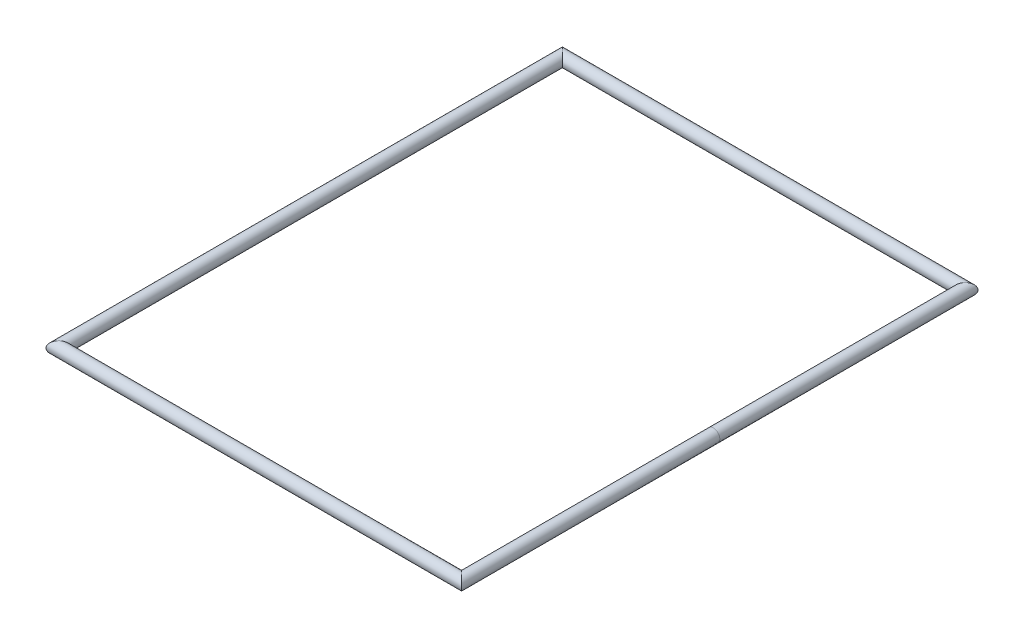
from build123d import *

# Parameters (mm, degrees)
SKETCH1_R   = 19
SKETCH1_R_2 = 17


with BuildPart() as part:
    # Sweep1: sweep along a path in Sketch2
    with BuildLine(Plane(origin=(0, 0, 0), x_dir=(1, 0, 0), z_dir=(0, 1, 0))) as sweep1_path:
        Line((-1200, -750), (0, -750))
        Line((0, -750), (0, 750))
        Line((0, 750), (-1200, 750))
        Line((-1200, 750), (-1200, -750))
    # Sketch1 → Sweep1 (sweep)
    with BuildSketch(Plane.XY):
        Circle(SKETCH1_R)
        Circle(SKETCH1_R_2, mode=Mode.SUBTRACT)
    sweep(path=sweep1_path.line, transition=Transition.RIGHT)


solid = part.part
